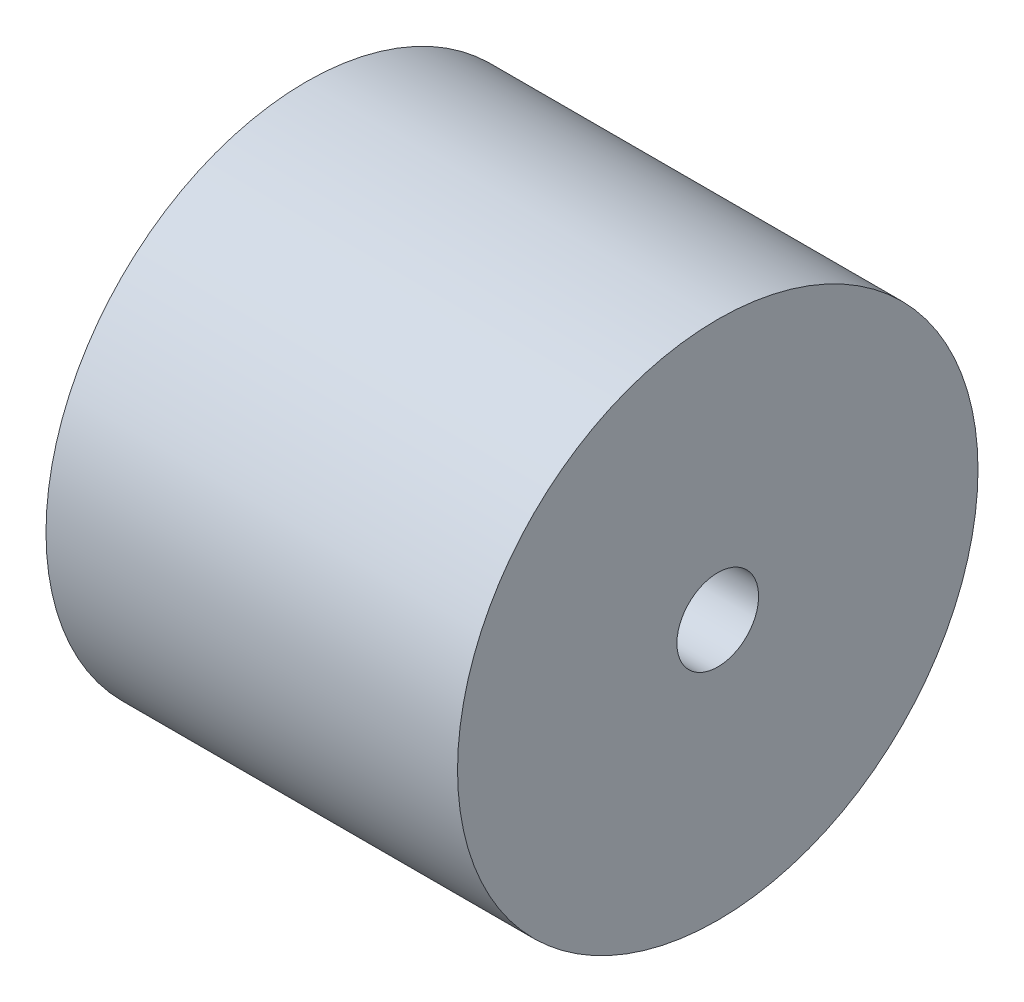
ISO-10303-21;
HEADER;
FILE_DESCRIPTION(('STEP AP214'),'2;1');
FILE_NAME('part.step','',(''),(''),'','','');
FILE_SCHEMA(('AUTOMOTIVE_DESIGN { 1 0 10303 214 1 1 1 1 }'));
ENDSEC;
DATA;
#1=APPLICATION_CONTEXT('core data for automotive mechanical design processes');
#2=APPLICATION_PROTOCOL_DEFINITION('international standard','automotive_design',2000,#1);
#3=PRODUCT_CONTEXT('',#1,'mechanical');
#4=PRODUCT('Part','Part','',(#3));
#5=PRODUCT_RELATED_PRODUCT_CATEGORY('part','',(#4));
#6=PRODUCT_DEFINITION_FORMATION('','',#4);
#7=PRODUCT_DEFINITION_CONTEXT('part definition',#1,'design');
#8=PRODUCT_DEFINITION('design','',#6,#7);
#9=PRODUCT_DEFINITION_SHAPE('','',#8);
#10=(LENGTH_UNIT() NAMED_UNIT(*) SI_UNIT(.MILLI.,.METRE.));
#11=(NAMED_UNIT(*) PLANE_ANGLE_UNIT() SI_UNIT($,.RADIAN.));
#12=(NAMED_UNIT(*) SI_UNIT($,.STERADIAN.) SOLID_ANGLE_UNIT());
#13=UNCERTAINTY_MEASURE_WITH_UNIT(LENGTH_MEASURE(1.E-05),#10,'distance_accuracy_value','');
#14=(GEOMETRIC_REPRESENTATION_CONTEXT(3) GLOBAL_UNCERTAINTY_ASSIGNED_CONTEXT((#13)) GLOBAL_UNIT_ASSIGNED_CONTEXT((#10,
#11,#12)) REPRESENTATION_CONTEXT('',''));
#15=CARTESIAN_POINT('',(0.,0.,0.));
#16=DIRECTION('',(0.,0.,1.));
#17=DIRECTION('',(1.,0.,0.));
#18=AXIS2_PLACEMENT_3D('',#15,#16,#17);
#19=CARTESIAN_POINT('',(34.,0.,0.));
#20=DIRECTION('',(-1.,0.,0.));
#21=DIRECTION('',(0.,0.,1.));
#22=AXIS2_PLACEMENT_3D('',#19,#20,#21);
#23=CYLINDRICAL_SURFACE('',#22,43.);
#24=CARTESIAN_POINT('',(34.,0.,0.));
#25=DIRECTION('',(1.,0.,0.));
#26=DIRECTION('',(0.,0.,-1.));
#27=AXIS2_PLACEMENT_3D('',#24,#25,#26);
#28=CIRCLE('',#27,43.);
#29=CARTESIAN_POINT('',(34.,0.,-43.));
#30=VERTEX_POINT('',#29);
#31=EDGE_CURVE('E10',#30,#30,#28,.T.);
#32=ORIENTED_EDGE('',*,*,#31,.F.);
#33=EDGE_LOOP('',(#32));
#34=FACE_BOUND('',#33,.T.);
#35=CARTESIAN_POINT('',(-34.,0.,0.));
#36=DIRECTION('',(1.,0.,0.));
#37=DIRECTION('',(0.,0.,-1.));
#38=AXIS2_PLACEMENT_3D('',#35,#36,#37);
#39=CIRCLE('',#38,43.);
#40=CARTESIAN_POINT('',(-34.,0.,-43.));
#41=VERTEX_POINT('',#40);
#42=EDGE_CURVE('E32',#41,#41,#39,.T.);
#43=ORIENTED_EDGE('',*,*,#42,.T.);
#44=EDGE_LOOP('',(#43));
#45=FACE_BOUND('',#44,.T.);
#46=ADVANCED_FACE('F29',(#34,#45),#23,.T.);
#47=CARTESIAN_POINT('',(34.,0.,0.));
#48=DIRECTION('',(1.,0.,0.));
#49=DIRECTION('',(0.,0.,-1.));
#50=AXIS2_PLACEMENT_3D('',#47,#48,#49);
#51=PLANE('',#50);
#52=CARTESIAN_POINT('',(34.,0.,0.));
#53=DIRECTION('',(-1.,0.,0.));
#54=DIRECTION('',(0.,0.,1.));
#55=AXIS2_PLACEMENT_3D('',#52,#53,#54);
#56=CIRCLE('',#55,6.75);
#57=CARTESIAN_POINT('',(34.,0.,6.75));
#58=VERTEX_POINT('',#57);
#59=EDGE_CURVE('E39',#58,#58,#56,.T.);
#60=ORIENTED_EDGE('',*,*,#59,.T.);
#61=EDGE_LOOP('',(#60));
#62=FACE_BOUND('',#61,.T.);
#63=ORIENTED_EDGE('',*,*,#31,.T.);
#64=EDGE_LOOP('',(#63));
#65=FACE_BOUND('',#64,.T.);
#66=ADVANCED_FACE('F47',(#62,#65),#51,.T.);
#67=CARTESIAN_POINT('',(-34.,0.,0.));
#68=DIRECTION('',(1.,0.,0.));
#69=DIRECTION('',(0.,0.,-1.));
#70=AXIS2_PLACEMENT_3D('',#67,#68,#69);
#71=PLANE('',#70);
#72=CARTESIAN_POINT('',(-34.,0.,0.));
#73=DIRECTION('',(-1.,0.,0.));
#74=DIRECTION('',(0.,0.,1.));
#75=AXIS2_PLACEMENT_3D('',#72,#73,#74);
#76=CIRCLE('',#75,6.75);
#77=CARTESIAN_POINT('',(-34.,0.,6.75));
#78=VERTEX_POINT('',#77);
#79=EDGE_CURVE('E41',#78,#78,#76,.T.);
#80=ORIENTED_EDGE('',*,*,#79,.F.);
#81=EDGE_LOOP('',(#80));
#82=FACE_BOUND('',#81,.T.);
#83=ORIENTED_EDGE('',*,*,#42,.F.);
#84=EDGE_LOOP('',(#83));
#85=FACE_BOUND('',#84,.T.);
#86=ADVANCED_FACE('F52',(#82,#85),#71,.F.);
#87=CARTESIAN_POINT('',(34.,0.,0.));
#88=DIRECTION('',(-1.,0.,0.));
#89=DIRECTION('',(0.,0.,1.));
#90=AXIS2_PLACEMENT_3D('',#87,#88,#89);
#91=CYLINDRICAL_SURFACE('',#90,6.75);
#92=ORIENTED_EDGE('',*,*,#59,.F.);
#93=EDGE_LOOP('',(#92));
#94=FACE_BOUND('',#93,.T.);
#95=ORIENTED_EDGE('',*,*,#79,.T.);
#96=EDGE_LOOP('',(#95));
#97=FACE_BOUND('',#96,.T.);
#98=ADVANCED_FACE('F49',(#94,#97),#91,.F.);
#99=CLOSED_SHELL('',(#46,#66,#86,#98));
#100=MANIFOLD_SOLID_BREP('B2',#99);
#101=ADVANCED_BREP_SHAPE_REPRESENTATION('',(#18,#100),#14);
#102=SHAPE_DEFINITION_REPRESENTATION(#9,#101);
ENDSEC;
END-ISO-10303-21;
